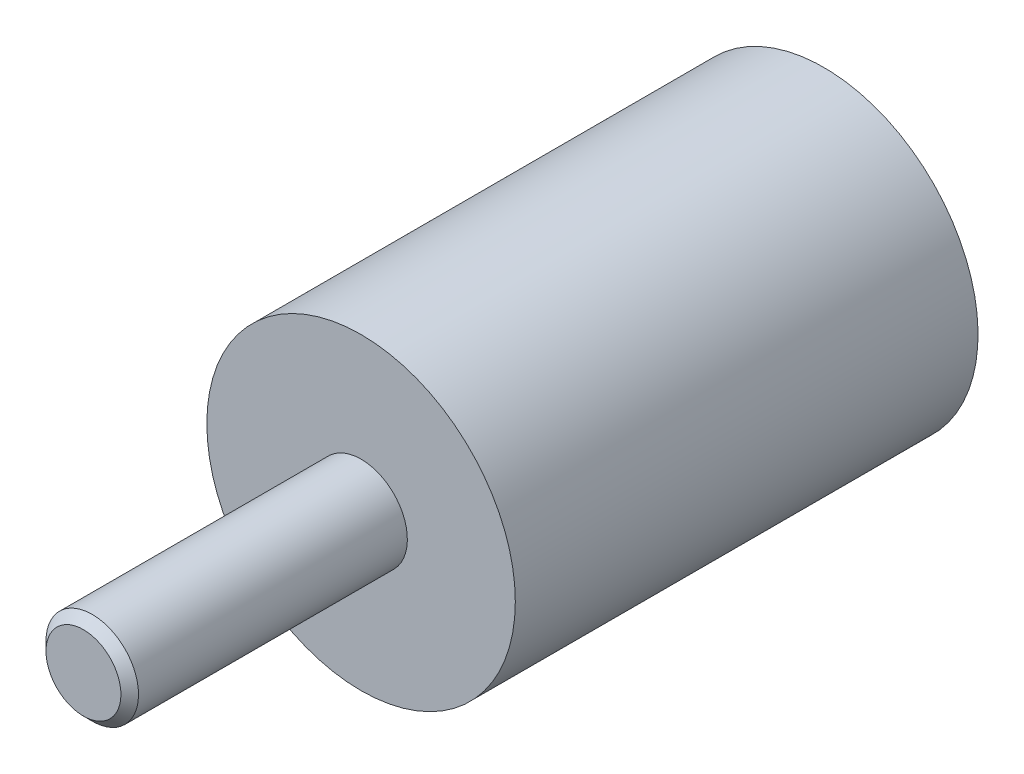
ISO-10303-21;
HEADER;
FILE_DESCRIPTION(('STEP AP214'),'2;1');
FILE_NAME('part.step','',(''),(''),'','','');
FILE_SCHEMA(('AUTOMOTIVE_DESIGN { 1 0 10303 214 1 1 1 1 }'));
ENDSEC;
DATA;
#1=APPLICATION_CONTEXT('core data for automotive mechanical design processes');
#2=APPLICATION_PROTOCOL_DEFINITION('international standard','automotive_design',2000,#1);
#3=PRODUCT_CONTEXT('',#1,'mechanical');
#4=PRODUCT('Part','Part','',(#3));
#5=PRODUCT_RELATED_PRODUCT_CATEGORY('part','',(#4));
#6=PRODUCT_DEFINITION_FORMATION('','',#4);
#7=PRODUCT_DEFINITION_CONTEXT('part definition',#1,'design');
#8=PRODUCT_DEFINITION('design','',#6,#7);
#9=PRODUCT_DEFINITION_SHAPE('','',#8);
#10=(LENGTH_UNIT() NAMED_UNIT(*) SI_UNIT(.MILLI.,.METRE.));
#11=(NAMED_UNIT(*) PLANE_ANGLE_UNIT() SI_UNIT($,.RADIAN.));
#12=(NAMED_UNIT(*) SI_UNIT($,.STERADIAN.) SOLID_ANGLE_UNIT());
#13=UNCERTAINTY_MEASURE_WITH_UNIT(LENGTH_MEASURE(1.E-05),#10,'distance_accuracy_value','');
#14=(GEOMETRIC_REPRESENTATION_CONTEXT(3) GLOBAL_UNCERTAINTY_ASSIGNED_CONTEXT((#13)) GLOBAL_UNIT_ASSIGNED_CONTEXT((#10,
#11,#12)) REPRESENTATION_CONTEXT('',''));
#15=CARTESIAN_POINT('',(0.,0.,0.));
#16=DIRECTION('',(0.,0.,1.));
#17=DIRECTION('',(1.,0.,0.));
#18=AXIS2_PLACEMENT_3D('',#15,#16,#17);
#19=CARTESIAN_POINT('',(10.,0.,30.));
#20=DIRECTION('',(0.,0.,1.));
#21=DIRECTION('',(0.,-1.,0.));
#22=AXIS2_PLACEMENT_3D('',#19,#20,#21);
#23=PLANE('',#22);
#24=CARTESIAN_POINT('',(0.,0.,30.));
#25=DIRECTION('',(0.,0.,-1.));
#26=DIRECTION('',(0.,1.,0.));
#27=AXIS2_PLACEMENT_3D('',#24,#25,#26);
#28=CIRCLE('',#27,3.);
#29=CARTESIAN_POINT('',(0.,3.,30.));
#30=VERTEX_POINT('',#29);
#31=EDGE_CURVE('E23',#30,#30,#28,.T.);
#32=ORIENTED_EDGE('',*,*,#31,.T.);
#33=EDGE_LOOP('',(#32));
#34=FACE_BOUND('',#33,.T.);
#35=CARTESIAN_POINT('',(0.,0.,30.));
#36=DIRECTION('',(0.,0.,-1.));
#37=DIRECTION('',(0.,1.,0.));
#38=AXIS2_PLACEMENT_3D('',#35,#36,#37);
#39=CIRCLE('',#38,10.);
#40=CARTESIAN_POINT('',(0.,10.,30.));
#41=VERTEX_POINT('',#40);
#42=EDGE_CURVE('E19',#41,#41,#39,.T.);
#43=ORIENTED_EDGE('',*,*,#42,.F.);
#44=EDGE_LOOP('',(#43));
#45=FACE_BOUND('',#44,.T.);
#46=ADVANCED_FACE('F12',(#34,#45),#23,.T.);
#47=CARTESIAN_POINT('',(0.,0.,0.));
#48=DIRECTION('',(0.,0.,-1.));
#49=DIRECTION('',(0.,1.,0.));
#50=AXIS2_PLACEMENT_3D('',#47,#48,#49);
#51=CYLINDRICAL_SURFACE('',#50,3.);
#52=CARTESIAN_POINT('',(0.,0.,47.4293600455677));
#53=DIRECTION('',(0.,0.,-1.));
#54=DIRECTION('',(0.,1.,0.));
#55=AXIS2_PLACEMENT_3D('',#52,#53,#54);
#56=CIRCLE('',#55,3.);
#57=CARTESIAN_POINT('',(0.,3.,47.4293600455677));
#58=VERTEX_POINT('',#57);
#59=EDGE_CURVE('E27',#58,#58,#56,.T.);
#60=ORIENTED_EDGE('',*,*,#59,.T.);
#61=EDGE_LOOP('',(#60));
#62=FACE_BOUND('',#61,.T.);
#63=ORIENTED_EDGE('',*,*,#31,.F.);
#64=EDGE_LOOP('',(#63));
#65=FACE_BOUND('',#64,.T.);
#66=ADVANCED_FACE('F48',(#62,#65),#51,.T.);
#67=CARTESIAN_POINT('',(0.,0.,47.4293600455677));
#68=DIRECTION('',(0.,0.,-1.));
#69=DIRECTION('',(0.,1.,0.));
#70=AXIS2_PLACEMENT_3D('',#67,#68,#69);
#71=CONICAL_SURFACE('',#70,3.,0.785398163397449);
#72=CARTESIAN_POINT('',(0.,0.,48.));
#73=DIRECTION('',(0.,0.,-1.));
#74=DIRECTION('',(0.,1.,0.));
#75=AXIS2_PLACEMENT_3D('',#72,#73,#74);
#76=CIRCLE('',#75,2.42936004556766);
#77=CARTESIAN_POINT('',(0.,2.42936004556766,48.));
#78=VERTEX_POINT('',#77);
#79=EDGE_CURVE('E32',#78,#78,#76,.T.);
#80=ORIENTED_EDGE('',*,*,#79,.T.);
#81=EDGE_LOOP('',(#80));
#82=FACE_BOUND('',#81,.T.);
#83=ORIENTED_EDGE('',*,*,#59,.F.);
#84=EDGE_LOOP('',(#83));
#85=FACE_BOUND('',#84,.T.);
#86=ADVANCED_FACE('F36',(#82,#85),#71,.T.);
#87=CARTESIAN_POINT('',(2.42936004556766,0.,48.));
#88=DIRECTION('',(0.,0.,1.));
#89=DIRECTION('',(0.,-1.,0.));
#90=AXIS2_PLACEMENT_3D('',#87,#88,#89);
#91=PLANE('',#90);
#92=ORIENTED_EDGE('',*,*,#79,.F.);
#93=EDGE_LOOP('',(#92));
#94=FACE_BOUND('',#93,.T.);
#95=ADVANCED_FACE('F39',(#94),#91,.T.);
#96=CARTESIAN_POINT('',(0.,0.,0.));
#97=DIRECTION('',(0.,0.,1.));
#98=DIRECTION('',(0.,-1.,0.));
#99=AXIS2_PLACEMENT_3D('',#96,#97,#98);
#100=CYLINDRICAL_SURFACE('',#99,10.);
#101=CARTESIAN_POINT('',(0.,0.,0.));
#102=DIRECTION('',(0.,0.,1.));
#103=DIRECTION('',(0.,-1.,0.));
#104=AXIS2_PLACEMENT_3D('',#101,#102,#103);
#105=CIRCLE('',#104,10.);
#106=CARTESIAN_POINT('',(0.,-10.,0.));
#107=VERTEX_POINT('',#106);
#108=EDGE_CURVE('E8',#107,#107,#105,.T.);
#109=ORIENTED_EDGE('',*,*,#108,.T.);
#110=EDGE_LOOP('',(#109));
#111=FACE_BOUND('',#110,.T.);
#112=ORIENTED_EDGE('',*,*,#42,.T.);
#113=EDGE_LOOP('',(#112));
#114=FACE_BOUND('',#113,.T.);
#115=ADVANCED_FACE('F14',(#111,#114),#100,.T.);
#116=CARTESIAN_POINT('',(10.,0.,0.));
#117=DIRECTION('',(0.,0.,-1.));
#118=DIRECTION('',(0.,1.,0.));
#119=AXIS2_PLACEMENT_3D('',#116,#117,#118);
#120=PLANE('',#119);
#121=ORIENTED_EDGE('',*,*,#108,.F.);
#122=EDGE_LOOP('',(#121));
#123=FACE_BOUND('',#122,.T.);
#124=ADVANCED_FACE('F47',(#123),#120,.T.);
#125=CLOSED_SHELL('',(#46,#66,#86,#95,#115,#124));
#126=MANIFOLD_SOLID_BREP('B1',#125);
#127=ADVANCED_BREP_SHAPE_REPRESENTATION('',(#18,#126),#14);
#128=SHAPE_DEFINITION_REPRESENTATION(#9,#127);
ENDSEC;
END-ISO-10303-21;
